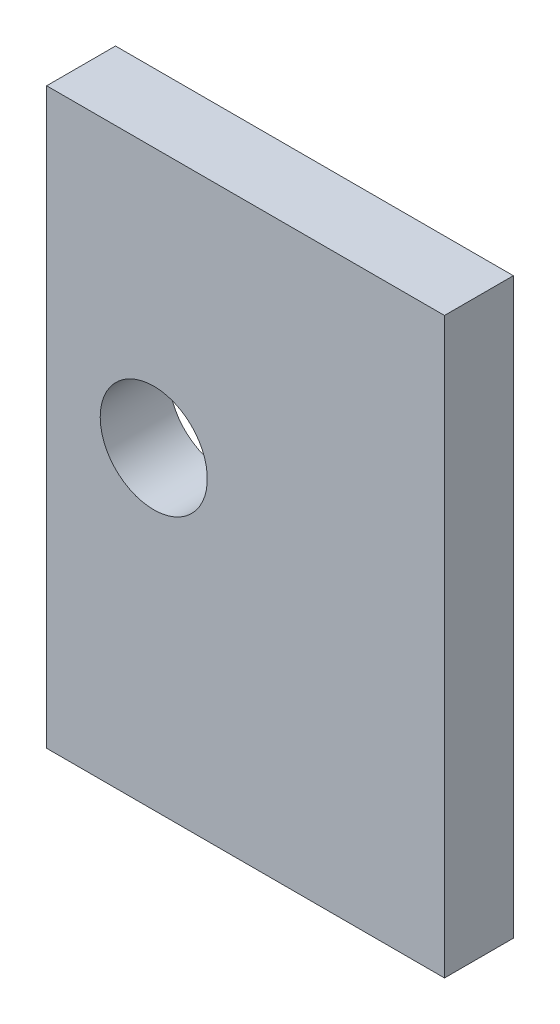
from build123d import *

# Parameters (mm, degrees)
ESQUISSE1_W             = 9
ESQUISSE1_H             = 75
BASE_DEPTH              = 26
ESQUISSE2_R             = 7
ENL_V_MAT_EXTRU_1_DEPTH = 9


with BuildPart() as part:
    # Esquisse1 → BASE (new, symmetric)
    with BuildSketch(Plane(origin=(0, 0, 0), x_dir=(0, 0, -1), z_dir=(1, 0, 0))):
        with Locations((4.5, 22.5)):
            Rectangle(ESQUISSE1_W, ESQUISSE1_H)
    extrude(amount=BASE_DEPTH, both=True)

    # Esquisse2 → Enl_v. mat.-Extru.1 (cut)
    with BuildSketch(Plane(origin=(0, 0, -9), x_dir=(-1, 0, 0), z_dir=(0, 0, -1))):
        with Locations((12, 26)):
            Circle(ESQUISSE2_R)
    extrude(amount=-ENL_V_MAT_EXTRU_1_DEPTH, mode=Mode.SUBTRACT)


solid = part.part
